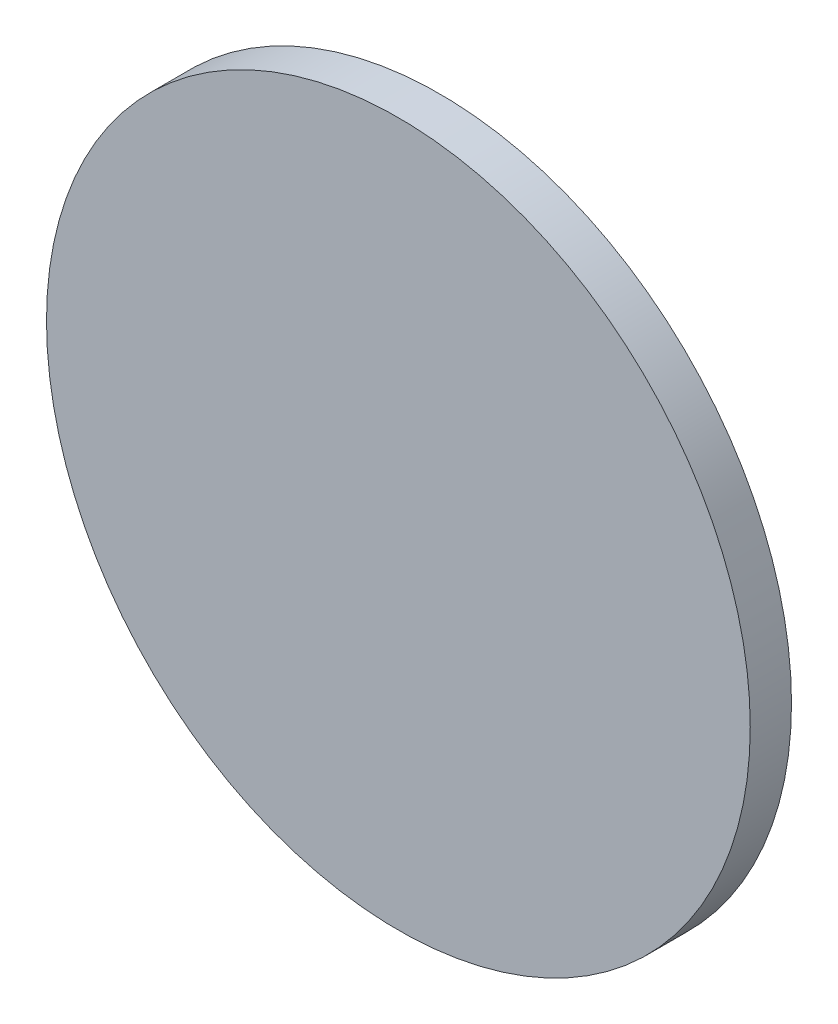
ISO-10303-21;
HEADER;
FILE_DESCRIPTION(('STEP AP214'),'2;1');
FILE_NAME('part.step','',(''),(''),'','','');
FILE_SCHEMA(('AUTOMOTIVE_DESIGN { 1 0 10303 214 1 1 1 1 }'));
ENDSEC;
DATA;
#1=APPLICATION_CONTEXT('core data for automotive mechanical design processes');
#2=APPLICATION_PROTOCOL_DEFINITION('international standard','automotive_design',2000,#1);
#3=PRODUCT_CONTEXT('',#1,'mechanical');
#4=PRODUCT('Part','Part','',(#3));
#5=PRODUCT_RELATED_PRODUCT_CATEGORY('part','',(#4));
#6=PRODUCT_DEFINITION_FORMATION('','',#4);
#7=PRODUCT_DEFINITION_CONTEXT('part definition',#1,'design');
#8=PRODUCT_DEFINITION('design','',#6,#7);
#9=PRODUCT_DEFINITION_SHAPE('','',#8);
#10=(LENGTH_UNIT() NAMED_UNIT(*) SI_UNIT(.MILLI.,.METRE.));
#11=(NAMED_UNIT(*) PLANE_ANGLE_UNIT() SI_UNIT($,.RADIAN.));
#12=(NAMED_UNIT(*) SI_UNIT($,.STERADIAN.) SOLID_ANGLE_UNIT());
#13=UNCERTAINTY_MEASURE_WITH_UNIT(LENGTH_MEASURE(1.E-05),#10,'distance_accuracy_value','');
#14=(GEOMETRIC_REPRESENTATION_CONTEXT(3) GLOBAL_UNCERTAINTY_ASSIGNED_CONTEXT((#13)) GLOBAL_UNIT_ASSIGNED_CONTEXT((#10,
#11,#12)) REPRESENTATION_CONTEXT('',''));
#15=CARTESIAN_POINT('',(0.,0.,0.));
#16=DIRECTION('',(0.,0.,1.));
#17=DIRECTION('',(1.,0.,0.));
#18=AXIS2_PLACEMENT_3D('',#15,#16,#17);
#19=CARTESIAN_POINT('',(0.,0.,3.6322));
#20=DIRECTION('',(0.,0.,-1.));
#21=DIRECTION('',(-1.,0.,0.));
#22=AXIS2_PLACEMENT_3D('',#19,#20,#21);
#23=CYLINDRICAL_SURFACE('',#22,30.988);
#24=CARTESIAN_POINT('',(0.,0.,3.6322));
#25=DIRECTION('',(0.,0.,1.));
#26=DIRECTION('',(1.,0.,0.));
#27=AXIS2_PLACEMENT_3D('',#24,#25,#26);
#28=CIRCLE('',#27,30.988);
#29=CARTESIAN_POINT('',(30.988,0.,3.6322));
#30=VERTEX_POINT('',#29);
#31=EDGE_CURVE('E10',#30,#30,#28,.T.);
#32=ORIENTED_EDGE('',*,*,#31,.F.);
#33=EDGE_LOOP('',(#32));
#34=FACE_BOUND('',#33,.T.);
#35=CARTESIAN_POINT('',(0.,0.,0.));
#36=DIRECTION('',(0.,0.,1.));
#37=DIRECTION('',(1.,0.,0.));
#38=AXIS2_PLACEMENT_3D('',#35,#36,#37);
#39=CIRCLE('',#38,30.988);
#40=CARTESIAN_POINT('',(30.988,0.,0.));
#41=VERTEX_POINT('',#40);
#42=EDGE_CURVE('E32',#41,#41,#39,.T.);
#43=ORIENTED_EDGE('',*,*,#42,.T.);
#44=EDGE_LOOP('',(#43));
#45=FACE_BOUND('',#44,.T.);
#46=ADVANCED_FACE('F26',(#34,#45),#23,.T.);
#47=CARTESIAN_POINT('',(0.,0.,3.6322));
#48=DIRECTION('',(0.,0.,1.));
#49=DIRECTION('',(1.,0.,0.));
#50=AXIS2_PLACEMENT_3D('',#47,#48,#49);
#51=PLANE('',#50);
#52=ORIENTED_EDGE('',*,*,#31,.T.);
#53=EDGE_LOOP('',(#52));
#54=FACE_BOUND('',#53,.T.);
#55=ADVANCED_FACE('F41',(#54),#51,.T.);
#56=CARTESIAN_POINT('',(0.,0.,0.));
#57=DIRECTION('',(0.,0.,1.));
#58=DIRECTION('',(1.,0.,0.));
#59=AXIS2_PLACEMENT_3D('',#56,#57,#58);
#60=PLANE('',#59);
#61=ORIENTED_EDGE('',*,*,#42,.F.);
#62=EDGE_LOOP('',(#61));
#63=FACE_BOUND('',#62,.T.);
#64=ADVANCED_FACE('F39',(#63),#60,.F.);
#65=CLOSED_SHELL('',(#46,#55,#64));
#66=MANIFOLD_SOLID_BREP('B2',#65);
#67=ADVANCED_BREP_SHAPE_REPRESENTATION('',(#18,#66),#14);
#68=SHAPE_DEFINITION_REPRESENTATION(#9,#67);
ENDSEC;
END-ISO-10303-21;
